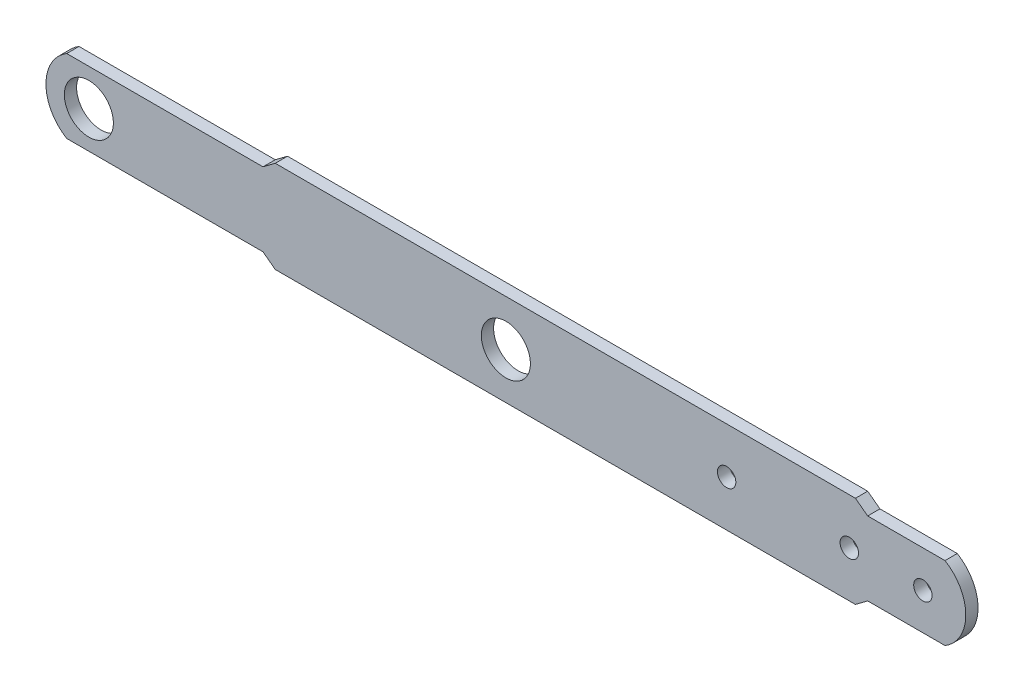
ISO-10303-21;
HEADER;
FILE_DESCRIPTION(('STEP AP214'),'2;1');
FILE_NAME('part.step','',(''),(''),'','','');
FILE_SCHEMA(('AUTOMOTIVE_DESIGN { 1 0 10303 214 1 1 1 1 }'));
ENDSEC;
DATA;
#1=APPLICATION_CONTEXT('core data for automotive mechanical design processes');
#2=APPLICATION_PROTOCOL_DEFINITION('international standard','automotive_design',2000,#1);
#3=PRODUCT_CONTEXT('',#1,'mechanical');
#4=PRODUCT('Part','Part','',(#3));
#5=PRODUCT_RELATED_PRODUCT_CATEGORY('part','',(#4));
#6=PRODUCT_DEFINITION_FORMATION('','',#4);
#7=PRODUCT_DEFINITION_CONTEXT('part definition',#1,'design');
#8=PRODUCT_DEFINITION('design','',#6,#7);
#9=PRODUCT_DEFINITION_SHAPE('','',#8);
#10=(LENGTH_UNIT() NAMED_UNIT(*) SI_UNIT(.MILLI.,.METRE.));
#11=(NAMED_UNIT(*) PLANE_ANGLE_UNIT() SI_UNIT($,.RADIAN.));
#12=(NAMED_UNIT(*) SI_UNIT($,.STERADIAN.) SOLID_ANGLE_UNIT());
#13=UNCERTAINTY_MEASURE_WITH_UNIT(LENGTH_MEASURE(1.E-05),#10,'distance_accuracy_value','');
#14=(GEOMETRIC_REPRESENTATION_CONTEXT(3) GLOBAL_UNCERTAINTY_ASSIGNED_CONTEXT((#13)) GLOBAL_UNIT_ASSIGNED_CONTEXT((#10,
#11,#12)) REPRESENTATION_CONTEXT('',''));
#15=CARTESIAN_POINT('',(0.,0.,0.));
#16=DIRECTION('',(0.,0.,1.));
#17=DIRECTION('',(1.,0.,0.));
#18=AXIS2_PLACEMENT_3D('',#15,#16,#17);
#19=CARTESIAN_POINT('',(-68.,0.,2.));
#20=DIRECTION('',(0.,0.,-1.));
#21=DIRECTION('',(-1.,0.,0.));
#22=AXIS2_PLACEMENT_3D('',#19,#20,#21);
#23=PLANE('',#22);
#24=CARTESIAN_POINT('',(0.,0.,2.));
#25=DIRECTION('',(0.,0.,1.));
#26=DIRECTION('',(1.,0.,0.));
#27=AXIS2_PLACEMENT_3D('',#24,#25,#26);
#28=CIRCLE('',#27,4.);
#29=CARTESIAN_POINT('',(4.,0.,2.));
#30=VERTEX_POINT('',#29);
#31=EDGE_CURVE('E311',#30,#30,#28,.T.);
#32=ORIENTED_EDGE('',*,*,#31,.F.);
#33=EDGE_LOOP('',(#32));
#34=FACE_BOUND('',#33,.T.);
#35=CARTESIAN_POINT('',(-68.,0.,2.));
#36=DIRECTION('',(0.,0.,1.));
#37=DIRECTION('',(-1.,0.,0.));
#38=AXIS2_PLACEMENT_3D('',#35,#36,#37);
#39=CIRCLE('',#38,4.00000000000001);
#40=CARTESIAN_POINT('',(-72.,0.,2.));
#41=VERTEX_POINT('',#40);
#42=EDGE_CURVE('E323',#41,#41,#39,.T.);
#43=ORIENTED_EDGE('',*,*,#42,.F.);
#44=EDGE_LOOP('',(#43));
#45=FACE_BOUND('',#44,.T.);
#46=DIRECTION('',(-1.,0.,0.));
#47=VECTOR('',#46,1.);
#48=CARTESIAN_POINT('',(57.,7.49999999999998,2.));
#49=LINE('',#48,#47);
#50=CARTESIAN_POINT('',(57.,7.49999999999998,2.));
#51=VERTEX_POINT('',#50);
#52=CARTESIAN_POINT('',(-37.605551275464,7.49999999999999,2.));
#53=VERTEX_POINT('',#52);
#54=EDGE_CURVE('E167',#51,#53,#49,.T.);
#55=ORIENTED_EDGE('',*,*,#54,.T.);
#56=DIRECTION('',(-0.800000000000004,-0.599999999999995,0.));
#57=VECTOR('',#56,1.);
#58=CARTESIAN_POINT('',(-37.605551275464,7.49999999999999,2.));
#59=LINE('',#58,#57);
#60=CARTESIAN_POINT('',(-39.605551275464,6.,2.));
#61=VERTEX_POINT('',#60);
#62=EDGE_CURVE('E136',#53,#61,#59,.T.);
#63=ORIENTED_EDGE('',*,*,#62,.T.);
#64=DIRECTION('',(-1.,0.,0.));
#65=VECTOR('',#64,1.);
#66=CARTESIAN_POINT('',(-71.605551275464,5.99999999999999,2.));
#67=LINE('',#66,#65);
#68=CARTESIAN_POINT('',(-71.605551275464,5.99999999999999,2.));
#69=VERTEX_POINT('',#68);
#70=EDGE_CURVE('E170',#61,#69,#67,.T.);
#71=ORIENTED_EDGE('',*,*,#70,.T.);
#72=CARTESIAN_POINT('',(-68.,0.,2.));
#73=DIRECTION('',(0.,0.,1.));
#74=DIRECTION('',(-1.,0.,0.));
#75=AXIS2_PLACEMENT_3D('',#72,#73,#74);
#76=CIRCLE('',#75,7.);
#77=CARTESIAN_POINT('',(-71.605551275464,-5.99999999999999,2.));
#78=VERTEX_POINT('',#77);
#79=EDGE_CURVE('E172',#69,#78,#76,.T.);
#80=ORIENTED_EDGE('',*,*,#79,.T.);
#81=DIRECTION('',(1.,0.,0.));
#82=VECTOR('',#81,1.);
#83=CARTESIAN_POINT('',(-71.605551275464,-5.99999999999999,2.));
#84=LINE('',#83,#82);
#85=CARTESIAN_POINT('',(-39.605551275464,-6.,2.));
#86=VERTEX_POINT('',#85);
#87=EDGE_CURVE('E174',#78,#86,#84,.T.);
#88=ORIENTED_EDGE('',*,*,#87,.T.);
#89=DIRECTION('',(0.800000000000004,-0.599999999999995,0.));
#90=VECTOR('',#89,1.);
#91=CARTESIAN_POINT('',(-37.605551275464,-7.49999999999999,2.));
#92=LINE('',#91,#90);
#93=CARTESIAN_POINT('',(-37.605551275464,-7.49999999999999,2.));
#94=VERTEX_POINT('',#93);
#95=EDGE_CURVE('E176',#86,#94,#92,.T.);
#96=ORIENTED_EDGE('',*,*,#95,.T.);
#97=DIRECTION('',(1.,0.,0.));
#98=VECTOR('',#97,1.);
#99=CARTESIAN_POINT('',(57.,-7.49999999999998,2.));
#100=LINE('',#99,#98);
#101=CARTESIAN_POINT('',(57.,-7.49999999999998,2.));
#102=VERTEX_POINT('',#101);
#103=EDGE_CURVE('E178',#94,#102,#100,.T.);
#104=ORIENTED_EDGE('',*,*,#103,.T.);
#105=DIRECTION('',(0.800000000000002,0.599999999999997,0.));
#106=VECTOR('',#105,1.);
#107=CARTESIAN_POINT('',(59.,-6.,2.));
#108=LINE('',#107,#106);
#109=CARTESIAN_POINT('',(59.,-6.,2.));
#110=VERTEX_POINT('',#109);
#111=EDGE_CURVE('E180',#102,#110,#108,.T.);
#112=ORIENTED_EDGE('',*,*,#111,.T.);
#113=DIRECTION('',(1.,0.,0.));
#114=VECTOR('',#113,1.);
#115=CARTESIAN_POINT('',(71.605551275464,-5.99999999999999,2.));
#116=LINE('',#115,#114);
#117=CARTESIAN_POINT('',(71.605551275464,-6.,2.));
#118=VERTEX_POINT('',#117);
#119=EDGE_CURVE('E182',#110,#118,#116,.T.);
#120=ORIENTED_EDGE('',*,*,#119,.T.);
#121=CARTESIAN_POINT('',(68.,0.,2.));
#122=DIRECTION('',(0.,0.,1.));
#123=DIRECTION('',(1.,0.,0.));
#124=AXIS2_PLACEMENT_3D('',#121,#122,#123);
#125=CIRCLE('',#124,7.);
#126=CARTESIAN_POINT('',(71.605551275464,5.99999999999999,2.));
#127=VERTEX_POINT('',#126);
#128=EDGE_CURVE('E184',#118,#127,#125,.T.);
#129=ORIENTED_EDGE('',*,*,#128,.T.);
#130=DIRECTION('',(-1.,0.,0.));
#131=VECTOR('',#130,1.);
#132=CARTESIAN_POINT('',(71.605551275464,5.99999999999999,2.));
#133=LINE('',#132,#131);
#134=CARTESIAN_POINT('',(59.,6.,2.));
#135=VERTEX_POINT('',#134);
#136=EDGE_CURVE('E53',#127,#135,#133,.T.);
#137=ORIENTED_EDGE('',*,*,#136,.T.);
#138=DIRECTION('',(-0.800000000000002,0.599999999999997,0.));
#139=VECTOR('',#138,1.);
#140=CARTESIAN_POINT('',(59.,6.,2.));
#141=LINE('',#140,#139);
#142=EDGE_CURVE('E48',#135,#51,#141,.T.);
#143=ORIENTED_EDGE('',*,*,#142,.T.);
#144=EDGE_LOOP('',(#55,#63,#71,#80,#88,#96,#104,#112,#120,#129,#137,#143));
#145=FACE_BOUND('',#144,.T.);
#146=CARTESIAN_POINT('',(68.,0.,2.));
#147=DIRECTION('',(0.,0.,1.));
#148=DIRECTION('',(1.,0.,0.));
#149=AXIS2_PLACEMENT_3D('',#146,#147,#148);
#150=CIRCLE('',#149,1.5);
#151=CARTESIAN_POINT('',(69.5,0.,2.));
#152=VERTEX_POINT('',#151);
#153=EDGE_CURVE('E141',#152,#152,#150,.T.);
#154=ORIENTED_EDGE('',*,*,#153,.F.);
#155=EDGE_LOOP('',(#154));
#156=FACE_BOUND('',#155,.T.);
#157=CARTESIAN_POINT('',(56.,0.,2.));
#158=DIRECTION('',(0.,0.,1.));
#159=DIRECTION('',(1.,0.,0.));
#160=AXIS2_PLACEMENT_3D('',#157,#158,#159);
#161=CIRCLE('',#160,1.5);
#162=CARTESIAN_POINT('',(57.5,0.,2.));
#163=VERTEX_POINT('',#162);
#164=EDGE_CURVE('E317',#163,#163,#161,.T.);
#165=ORIENTED_EDGE('',*,*,#164,.F.);
#166=EDGE_LOOP('',(#165));
#167=FACE_BOUND('',#166,.T.);
#168=CARTESIAN_POINT('',(36.,0.,2.));
#169=DIRECTION('',(0.,0.,1.));
#170=DIRECTION('',(1.,0.,0.));
#171=AXIS2_PLACEMENT_3D('',#168,#169,#170);
#172=CIRCLE('',#171,1.5);
#173=CARTESIAN_POINT('',(37.5,0.,2.));
#174=VERTEX_POINT('',#173);
#175=EDGE_CURVE('E300',#174,#174,#172,.T.);
#176=ORIENTED_EDGE('',*,*,#175,.F.);
#177=EDGE_LOOP('',(#176));
#178=FACE_BOUND('',#177,.T.);
#179=ADVANCED_FACE('F33',(#34,#45,#145,#156,#167,#178),#23,.F.);
#180=CARTESIAN_POINT('',(-68.,0.,0.));
#181=DIRECTION('',(0.,0.,-1.));
#182=DIRECTION('',(-1.,0.,0.));
#183=AXIS2_PLACEMENT_3D('',#180,#181,#182);
#184=PLANE('',#183);
#185=CARTESIAN_POINT('',(0.,0.,0.));
#186=DIRECTION('',(0.,0.,1.));
#187=DIRECTION('',(1.,0.,0.));
#188=AXIS2_PLACEMENT_3D('',#185,#186,#187);
#189=CIRCLE('',#188,4.);
#190=CARTESIAN_POINT('',(4.,0.,0.));
#191=VERTEX_POINT('',#190);
#192=EDGE_CURVE('E306',#191,#191,#189,.T.);
#193=ORIENTED_EDGE('',*,*,#192,.T.);
#194=EDGE_LOOP('',(#193));
#195=FACE_BOUND('',#194,.T.);
#196=CARTESIAN_POINT('',(-68.,0.,0.));
#197=DIRECTION('',(0.,0.,1.));
#198=DIRECTION('',(-1.,0.,0.));
#199=AXIS2_PLACEMENT_3D('',#196,#197,#198);
#200=CIRCLE('',#199,4.00000000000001);
#201=CARTESIAN_POINT('',(-72.,0.,0.));
#202=VERTEX_POINT('',#201);
#203=EDGE_CURVE('E320',#202,#202,#200,.T.);
#204=ORIENTED_EDGE('',*,*,#203,.T.);
#205=EDGE_LOOP('',(#204));
#206=FACE_BOUND('',#205,.T.);
#207=DIRECTION('',(-1.,0.,0.));
#208=VECTOR('',#207,1.);
#209=CARTESIAN_POINT('',(57.,7.49999999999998,0.));
#210=LINE('',#209,#208);
#211=CARTESIAN_POINT('',(57.,7.49999999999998,0.));
#212=VERTEX_POINT('',#211);
#213=CARTESIAN_POINT('',(-37.605551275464,7.49999999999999,0.));
#214=VERTEX_POINT('',#213);
#215=EDGE_CURVE('E127',#212,#214,#210,.T.);
#216=ORIENTED_EDGE('',*,*,#215,.F.);
#217=DIRECTION('',(-0.800000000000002,0.599999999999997,0.));
#218=VECTOR('',#217,1.);
#219=CARTESIAN_POINT('',(59.,6.,0.));
#220=LINE('',#219,#218);
#221=CARTESIAN_POINT('',(59.,6.,0.));
#222=VERTEX_POINT('',#221);
#223=EDGE_CURVE('E165',#222,#212,#220,.T.);
#224=ORIENTED_EDGE('',*,*,#223,.F.);
#225=DIRECTION('',(-1.,0.,0.));
#226=VECTOR('',#225,1.);
#227=CARTESIAN_POINT('',(71.605551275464,5.99999999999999,0.));
#228=LINE('',#227,#226);
#229=CARTESIAN_POINT('',(71.605551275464,5.99999999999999,0.));
#230=VERTEX_POINT('',#229);
#231=EDGE_CURVE('E163',#230,#222,#228,.T.);
#232=ORIENTED_EDGE('',*,*,#231,.F.);
#233=CARTESIAN_POINT('',(68.,0.,0.));
#234=DIRECTION('',(0.,0.,1.));
#235=DIRECTION('',(1.,0.,0.));
#236=AXIS2_PLACEMENT_3D('',#233,#234,#235);
#237=CIRCLE('',#236,7.);
#238=CARTESIAN_POINT('',(71.605551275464,-6.,0.));
#239=VERTEX_POINT('',#238);
#240=EDGE_CURVE('E161',#239,#230,#237,.T.);
#241=ORIENTED_EDGE('',*,*,#240,.F.);
#242=DIRECTION('',(1.,0.,0.));
#243=VECTOR('',#242,1.);
#244=CARTESIAN_POINT('',(71.605551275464,-5.99999999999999,0.));
#245=LINE('',#244,#243);
#246=CARTESIAN_POINT('',(59.,-6.,0.));
#247=VERTEX_POINT('',#246);
#248=EDGE_CURVE('E159',#247,#239,#245,.T.);
#249=ORIENTED_EDGE('',*,*,#248,.F.);
#250=DIRECTION('',(0.800000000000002,0.599999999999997,0.));
#251=VECTOR('',#250,1.);
#252=CARTESIAN_POINT('',(59.,-6.,0.));
#253=LINE('',#252,#251);
#254=CARTESIAN_POINT('',(57.,-7.49999999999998,0.));
#255=VERTEX_POINT('',#254);
#256=EDGE_CURVE('E157',#255,#247,#253,.T.);
#257=ORIENTED_EDGE('',*,*,#256,.F.);
#258=DIRECTION('',(1.,0.,0.));
#259=VECTOR('',#258,1.);
#260=CARTESIAN_POINT('',(57.,-7.49999999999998,0.));
#261=LINE('',#260,#259);
#262=CARTESIAN_POINT('',(-37.605551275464,-7.49999999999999,0.));
#263=VERTEX_POINT('',#262);
#264=EDGE_CURVE('E155',#263,#255,#261,.T.);
#265=ORIENTED_EDGE('',*,*,#264,.F.);
#266=DIRECTION('',(0.800000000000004,-0.599999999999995,0.));
#267=VECTOR('',#266,1.);
#268=CARTESIAN_POINT('',(-37.605551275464,-7.49999999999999,0.));
#269=LINE('',#268,#267);
#270=CARTESIAN_POINT('',(-39.605551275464,-6.,0.));
#271=VERTEX_POINT('',#270);
#272=EDGE_CURVE('E153',#271,#263,#269,.T.);
#273=ORIENTED_EDGE('',*,*,#272,.F.);
#274=DIRECTION('',(1.,0.,0.));
#275=VECTOR('',#274,1.);
#276=CARTESIAN_POINT('',(-71.605551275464,-5.99999999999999,0.));
#277=LINE('',#276,#275);
#278=CARTESIAN_POINT('',(-71.605551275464,-5.99999999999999,0.));
#279=VERTEX_POINT('',#278);
#280=EDGE_CURVE('E151',#279,#271,#277,.T.);
#281=ORIENTED_EDGE('',*,*,#280,.F.);
#282=CARTESIAN_POINT('',(-68.,0.,0.));
#283=DIRECTION('',(0.,0.,1.));
#284=DIRECTION('',(-1.,0.,0.));
#285=AXIS2_PLACEMENT_3D('',#282,#283,#284);
#286=CIRCLE('',#285,7.);
#287=CARTESIAN_POINT('',(-71.605551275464,5.99999999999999,0.));
#288=VERTEX_POINT('',#287);
#289=EDGE_CURVE('E149',#288,#279,#286,.T.);
#290=ORIENTED_EDGE('',*,*,#289,.F.);
#291=DIRECTION('',(-1.,0.,0.));
#292=VECTOR('',#291,1.);
#293=CARTESIAN_POINT('',(-71.605551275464,5.99999999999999,0.));
#294=LINE('',#293,#292);
#295=CARTESIAN_POINT('',(-39.605551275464,6.,0.));
#296=VERTEX_POINT('',#295);
#297=EDGE_CURVE('E129',#296,#288,#294,.T.);
#298=ORIENTED_EDGE('',*,*,#297,.F.);
#299=DIRECTION('',(-0.800000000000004,-0.599999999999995,0.));
#300=VECTOR('',#299,1.);
#301=CARTESIAN_POINT('',(-37.605551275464,7.49999999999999,0.));
#302=LINE('',#301,#300);
#303=EDGE_CURVE('E122',#214,#296,#302,.T.);
#304=ORIENTED_EDGE('',*,*,#303,.F.);
#305=EDGE_LOOP('',(#216,#224,#232,#241,#249,#257,#265,#273,#281,#290,#298,#304));
#306=FACE_BOUND('',#305,.T.);
#307=CARTESIAN_POINT('',(68.,0.,0.));
#308=DIRECTION('',(0.,0.,1.));
#309=DIRECTION('',(1.,0.,0.));
#310=AXIS2_PLACEMENT_3D('',#307,#308,#309);
#311=CIRCLE('',#310,1.5);
#312=CARTESIAN_POINT('',(69.5,0.,0.));
#313=VERTEX_POINT('',#312);
#314=EDGE_CURVE('E144',#313,#313,#311,.T.);
#315=ORIENTED_EDGE('',*,*,#314,.T.);
#316=EDGE_LOOP('',(#315));
#317=FACE_BOUND('',#316,.T.);
#318=CARTESIAN_POINT('',(56.,0.,0.));
#319=DIRECTION('',(0.,0.,1.));
#320=DIRECTION('',(1.,0.,0.));
#321=AXIS2_PLACEMENT_3D('',#318,#319,#320);
#322=CIRCLE('',#321,1.5);
#323=CARTESIAN_POINT('',(57.5,0.,0.));
#324=VERTEX_POINT('',#323);
#325=EDGE_CURVE('E314',#324,#324,#322,.T.);
#326=ORIENTED_EDGE('',*,*,#325,.T.);
#327=EDGE_LOOP('',(#326));
#328=FACE_BOUND('',#327,.T.);
#329=CARTESIAN_POINT('',(36.,0.,0.));
#330=DIRECTION('',(0.,0.,1.));
#331=DIRECTION('',(1.,0.,0.));
#332=AXIS2_PLACEMENT_3D('',#329,#330,#331);
#333=CIRCLE('',#332,1.5);
#334=CARTESIAN_POINT('',(37.5,0.,0.));
#335=VERTEX_POINT('',#334);
#336=EDGE_CURVE('E303',#335,#335,#333,.T.);
#337=ORIENTED_EDGE('',*,*,#336,.T.);
#338=EDGE_LOOP('',(#337));
#339=FACE_BOUND('',#338,.T.);
#340=ADVANCED_FACE('F123',(#195,#206,#306,#317,#328,#339),#184,.T.);
#341=CARTESIAN_POINT('',(57.,7.49999999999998,2.));
#342=DIRECTION('',(0.,-1.,0.));
#343=DIRECTION('',(1.,0.,0.));
#344=AXIS2_PLACEMENT_3D('',#341,#342,#343);
#345=PLANE('',#344);
#346=ORIENTED_EDGE('',*,*,#215,.T.);
#347=DIRECTION('',(0.,0.,-1.));
#348=VECTOR('',#347,1.);
#349=CARTESIAN_POINT('',(-37.605551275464,7.49999999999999,2.));
#350=LINE('',#349,#348);
#351=EDGE_CURVE('E11',#53,#214,#350,.T.);
#352=ORIENTED_EDGE('',*,*,#351,.F.);
#353=ORIENTED_EDGE('',*,*,#54,.F.);
#354=DIRECTION('',(0.,0.,-1.));
#355=VECTOR('',#354,1.);
#356=CARTESIAN_POINT('',(57.,7.49999999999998,2.));
#357=LINE('',#356,#355);
#358=EDGE_CURVE('E140',#51,#212,#357,.T.);
#359=ORIENTED_EDGE('',*,*,#358,.T.);
#360=EDGE_LOOP('',(#346,#352,#353,#359));
#361=FACE_BOUND('',#360,.T.);
#362=ADVANCED_FACE('F35',(#361),#345,.F.);
#363=CARTESIAN_POINT('',(-37.605551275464,7.49999999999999,2.));
#364=DIRECTION('',(0.599999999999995,-0.800000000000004,0.));
#365=DIRECTION('',(0.800000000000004,0.599999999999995,0.));
#366=AXIS2_PLACEMENT_3D('',#363,#364,#365);
#367=PLANE('',#366);
#368=ORIENTED_EDGE('',*,*,#303,.T.);
#369=DIRECTION('',(0.,0.,-1.));
#370=VECTOR('',#369,1.);
#371=CARTESIAN_POINT('',(-39.605551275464,6.,2.));
#372=LINE('',#371,#370);
#373=EDGE_CURVE('E41',#61,#296,#372,.T.);
#374=ORIENTED_EDGE('',*,*,#373,.F.);
#375=ORIENTED_EDGE('',*,*,#62,.F.);
#376=ORIENTED_EDGE('',*,*,#351,.T.);
#377=EDGE_LOOP('',(#368,#374,#375,#376));
#378=FACE_BOUND('',#377,.T.);
#379=ADVANCED_FACE('F135',(#378),#367,.F.);
#380=CARTESIAN_POINT('',(-71.605551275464,5.99999999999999,2.));
#381=DIRECTION('',(0.,-1.,0.));
#382=DIRECTION('',(1.,0.,0.));
#383=AXIS2_PLACEMENT_3D('',#380,#381,#382);
#384=PLANE('',#383);
#385=ORIENTED_EDGE('',*,*,#297,.T.);
#386=DIRECTION('',(0.,0.,-1.));
#387=VECTOR('',#386,1.);
#388=CARTESIAN_POINT('',(-71.605551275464,5.99999999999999,2.));
#389=LINE('',#388,#387);
#390=EDGE_CURVE('E213',#69,#288,#389,.T.);
#391=ORIENTED_EDGE('',*,*,#390,.F.);
#392=ORIENTED_EDGE('',*,*,#70,.F.);
#393=ORIENTED_EDGE('',*,*,#373,.T.);
#394=EDGE_LOOP('',(#385,#391,#392,#393));
#395=FACE_BOUND('',#394,.T.);
#396=ADVANCED_FACE('F217',(#395),#384,.F.);
#397=CARTESIAN_POINT('',(-68.,0.,2.));
#398=DIRECTION('',(0.,0.,-1.));
#399=DIRECTION('',(-1.,0.,0.));
#400=AXIS2_PLACEMENT_3D('',#397,#398,#399);
#401=CYLINDRICAL_SURFACE('',#400,7.);
#402=ORIENTED_EDGE('',*,*,#289,.T.);
#403=DIRECTION('',(0.,0.,-1.));
#404=VECTOR('',#403,1.);
#405=CARTESIAN_POINT('',(-71.605551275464,-5.99999999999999,2.));
#406=LINE('',#405,#404);
#407=EDGE_CURVE('E210',#78,#279,#406,.T.);
#408=ORIENTED_EDGE('',*,*,#407,.F.);
#409=ORIENTED_EDGE('',*,*,#79,.F.);
#410=ORIENTED_EDGE('',*,*,#390,.T.);
#411=EDGE_LOOP('',(#402,#408,#409,#410));
#412=FACE_BOUND('',#411,.T.);
#413=ADVANCED_FACE('F225',(#412),#401,.T.);
#414=CARTESIAN_POINT('',(-71.605551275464,-5.99999999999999,2.));
#415=DIRECTION('',(0.,1.,0.));
#416=DIRECTION('',(-1.,0.,0.));
#417=AXIS2_PLACEMENT_3D('',#414,#415,#416);
#418=PLANE('',#417);
#419=ORIENTED_EDGE('',*,*,#280,.T.);
#420=DIRECTION('',(0.,0.,-1.));
#421=VECTOR('',#420,1.);
#422=CARTESIAN_POINT('',(-39.605551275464,-6.,2.));
#423=LINE('',#422,#421);
#424=EDGE_CURVE('E207',#86,#271,#423,.T.);
#425=ORIENTED_EDGE('',*,*,#424,.F.);
#426=ORIENTED_EDGE('',*,*,#87,.F.);
#427=ORIENTED_EDGE('',*,*,#407,.T.);
#428=EDGE_LOOP('',(#419,#425,#426,#427));
#429=FACE_BOUND('',#428,.T.);
#430=ADVANCED_FACE('F228',(#429),#418,.F.);
#431=CARTESIAN_POINT('',(-37.605551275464,-7.49999999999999,2.));
#432=DIRECTION('',(0.599999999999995,0.800000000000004,0.));
#433=DIRECTION('',(-0.800000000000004,0.599999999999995,0.));
#434=AXIS2_PLACEMENT_3D('',#431,#432,#433);
#435=PLANE('',#434);
#436=ORIENTED_EDGE('',*,*,#272,.T.);
#437=DIRECTION('',(0.,0.,-1.));
#438=VECTOR('',#437,1.);
#439=CARTESIAN_POINT('',(-37.605551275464,-7.49999999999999,2.));
#440=LINE('',#439,#438);
#441=EDGE_CURVE('E204',#94,#263,#440,.T.);
#442=ORIENTED_EDGE('',*,*,#441,.F.);
#443=ORIENTED_EDGE('',*,*,#95,.F.);
#444=ORIENTED_EDGE('',*,*,#424,.T.);
#445=EDGE_LOOP('',(#436,#442,#443,#444));
#446=FACE_BOUND('',#445,.T.);
#447=ADVANCED_FACE('F233',(#446),#435,.F.);
#448=CARTESIAN_POINT('',(57.,-7.49999999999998,2.));
#449=DIRECTION('',(0.,1.,0.));
#450=DIRECTION('',(-1.,0.,0.));
#451=AXIS2_PLACEMENT_3D('',#448,#449,#450);
#452=PLANE('',#451);
#453=ORIENTED_EDGE('',*,*,#264,.T.);
#454=DIRECTION('',(0.,0.,-1.));
#455=VECTOR('',#454,1.);
#456=CARTESIAN_POINT('',(57.,-7.49999999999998,2.));
#457=LINE('',#456,#455);
#458=EDGE_CURVE('E201',#102,#255,#457,.T.);
#459=ORIENTED_EDGE('',*,*,#458,.F.);
#460=ORIENTED_EDGE('',*,*,#103,.F.);
#461=ORIENTED_EDGE('',*,*,#441,.T.);
#462=EDGE_LOOP('',(#453,#459,#460,#461));
#463=FACE_BOUND('',#462,.T.);
#464=ADVANCED_FACE('F239',(#463),#452,.F.);
#465=CARTESIAN_POINT('',(59.,-6.,2.));
#466=DIRECTION('',(-0.599999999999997,0.800000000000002,0.));
#467=DIRECTION('',(-0.800000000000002,-0.599999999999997,0.));
#468=AXIS2_PLACEMENT_3D('',#465,#466,#467);
#469=PLANE('',#468);
#470=ORIENTED_EDGE('',*,*,#256,.T.);
#471=DIRECTION('',(0.,0.,-1.));
#472=VECTOR('',#471,1.);
#473=CARTESIAN_POINT('',(59.,-6.,2.));
#474=LINE('',#473,#472);
#475=EDGE_CURVE('E198',#110,#247,#474,.T.);
#476=ORIENTED_EDGE('',*,*,#475,.F.);
#477=ORIENTED_EDGE('',*,*,#111,.F.);
#478=ORIENTED_EDGE('',*,*,#458,.T.);
#479=EDGE_LOOP('',(#470,#476,#477,#478));
#480=FACE_BOUND('',#479,.T.);
#481=ADVANCED_FACE('F243',(#480),#469,.F.);
#482=CARTESIAN_POINT('',(71.605551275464,-5.99999999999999,2.));
#483=DIRECTION('',(0.,1.,0.));
#484=DIRECTION('',(-1.,0.,0.));
#485=AXIS2_PLACEMENT_3D('',#482,#483,#484);
#486=PLANE('',#485);
#487=ORIENTED_EDGE('',*,*,#248,.T.);
#488=DIRECTION('',(0.,0.,-1.));
#489=VECTOR('',#488,1.);
#490=CARTESIAN_POINT('',(71.605551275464,-6.,2.));
#491=LINE('',#490,#489);
#492=EDGE_CURVE('E195',#118,#239,#491,.T.);
#493=ORIENTED_EDGE('',*,*,#492,.F.);
#494=ORIENTED_EDGE('',*,*,#119,.F.);
#495=ORIENTED_EDGE('',*,*,#475,.T.);
#496=EDGE_LOOP('',(#487,#493,#494,#495));
#497=FACE_BOUND('',#496,.T.);
#498=ADVANCED_FACE('F248',(#497),#486,.F.);
#499=CARTESIAN_POINT('',(68.,0.,2.));
#500=DIRECTION('',(0.,0.,-1.));
#501=DIRECTION('',(-1.,0.,0.));
#502=AXIS2_PLACEMENT_3D('',#499,#500,#501);
#503=CYLINDRICAL_SURFACE('',#502,7.);
#504=ORIENTED_EDGE('',*,*,#240,.T.);
#505=DIRECTION('',(0.,0.,-1.));
#506=VECTOR('',#505,1.);
#507=CARTESIAN_POINT('',(71.605551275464,5.99999999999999,2.));
#508=LINE('',#507,#506);
#509=EDGE_CURVE('E192',#127,#230,#508,.T.);
#510=ORIENTED_EDGE('',*,*,#509,.F.);
#511=ORIENTED_EDGE('',*,*,#128,.F.);
#512=ORIENTED_EDGE('',*,*,#492,.T.);
#513=EDGE_LOOP('',(#504,#510,#511,#512));
#514=FACE_BOUND('',#513,.T.);
#515=ADVANCED_FACE('F252',(#514),#503,.T.);
#516=CARTESIAN_POINT('',(71.605551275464,5.99999999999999,2.));
#517=DIRECTION('',(0.,-1.,0.));
#518=DIRECTION('',(1.,0.,0.));
#519=AXIS2_PLACEMENT_3D('',#516,#517,#518);
#520=PLANE('',#519);
#521=ORIENTED_EDGE('',*,*,#231,.T.);
#522=DIRECTION('',(0.,0.,-1.));
#523=VECTOR('',#522,1.);
#524=CARTESIAN_POINT('',(59.,6.,2.));
#525=LINE('',#524,#523);
#526=EDGE_CURVE('E189',#135,#222,#525,.T.);
#527=ORIENTED_EDGE('',*,*,#526,.F.);
#528=ORIENTED_EDGE('',*,*,#136,.F.);
#529=ORIENTED_EDGE('',*,*,#509,.T.);
#530=EDGE_LOOP('',(#521,#527,#528,#529));
#531=FACE_BOUND('',#530,.T.);
#532=ADVANCED_FACE('F256',(#531),#520,.F.);
#533=CARTESIAN_POINT('',(59.,6.,2.));
#534=DIRECTION('',(-0.599999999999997,-0.800000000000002,0.));
#535=DIRECTION('',(0.800000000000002,-0.599999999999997,0.));
#536=AXIS2_PLACEMENT_3D('',#533,#534,#535);
#537=PLANE('',#536);
#538=ORIENTED_EDGE('',*,*,#223,.T.);
#539=ORIENTED_EDGE('',*,*,#358,.F.);
#540=ORIENTED_EDGE('',*,*,#142,.F.);
#541=ORIENTED_EDGE('',*,*,#526,.T.);
#542=EDGE_LOOP('',(#538,#539,#540,#541));
#543=FACE_BOUND('',#542,.T.);
#544=ADVANCED_FACE('F258',(#543),#537,.F.);
#545=CARTESIAN_POINT('',(68.,0.,2.));
#546=DIRECTION('',(0.,0.,-1.));
#547=DIRECTION('',(-1.,0.,0.));
#548=AXIS2_PLACEMENT_3D('',#545,#546,#547);
#549=CYLINDRICAL_SURFACE('',#548,1.5);
#550=ORIENTED_EDGE('',*,*,#153,.T.);
#551=EDGE_LOOP('',(#550));
#552=FACE_BOUND('',#551,.T.);
#553=ORIENTED_EDGE('',*,*,#314,.F.);
#554=EDGE_LOOP('',(#553));
#555=FACE_BOUND('',#554,.T.);
#556=ADVANCED_FACE('F260',(#552,#555),#549,.F.);
#557=CARTESIAN_POINT('',(-68.,0.,2.));
#558=DIRECTION('',(0.,0.,-1.));
#559=DIRECTION('',(-1.,0.,0.));
#560=AXIS2_PLACEMENT_3D('',#557,#558,#559);
#561=CYLINDRICAL_SURFACE('',#560,4.00000000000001);
#562=ORIENTED_EDGE('',*,*,#42,.T.);
#563=EDGE_LOOP('',(#562));
#564=FACE_BOUND('',#563,.T.);
#565=ORIENTED_EDGE('',*,*,#203,.F.);
#566=EDGE_LOOP('',(#565));
#567=FACE_BOUND('',#566,.T.);
#568=ADVANCED_FACE('F266',(#564,#567),#561,.F.);
#569=CARTESIAN_POINT('',(56.,0.,2.));
#570=DIRECTION('',(0.,0.,-1.));
#571=DIRECTION('',(-1.,0.,0.));
#572=AXIS2_PLACEMENT_3D('',#569,#570,#571);
#573=CYLINDRICAL_SURFACE('',#572,1.5);
#574=ORIENTED_EDGE('',*,*,#164,.T.);
#575=EDGE_LOOP('',(#574));
#576=FACE_BOUND('',#575,.T.);
#577=ORIENTED_EDGE('',*,*,#325,.F.);
#578=EDGE_LOOP('',(#577));
#579=FACE_BOUND('',#578,.T.);
#580=ADVANCED_FACE('F283',(#576,#579),#573,.F.);
#581=CARTESIAN_POINT('',(0.,0.,2.));
#582=DIRECTION('',(0.,0.,-1.));
#583=DIRECTION('',(-1.,0.,0.));
#584=AXIS2_PLACEMENT_3D('',#581,#582,#583);
#585=CYLINDRICAL_SURFACE('',#584,4.);
#586=ORIENTED_EDGE('',*,*,#31,.T.);
#587=EDGE_LOOP('',(#586));
#588=FACE_BOUND('',#587,.T.);
#589=ORIENTED_EDGE('',*,*,#192,.F.);
#590=EDGE_LOOP('',(#589));
#591=FACE_BOUND('',#590,.T.);
#592=ADVANCED_FACE('F287',(#588,#591),#585,.F.);
#593=CARTESIAN_POINT('',(36.,0.,2.));
#594=DIRECTION('',(0.,0.,-1.));
#595=DIRECTION('',(-1.,0.,0.));
#596=AXIS2_PLACEMENT_3D('',#593,#594,#595);
#597=CYLINDRICAL_SURFACE('',#596,1.5);
#598=ORIENTED_EDGE('',*,*,#175,.T.);
#599=EDGE_LOOP('',(#598));
#600=FACE_BOUND('',#599,.T.);
#601=ORIENTED_EDGE('',*,*,#336,.F.);
#602=EDGE_LOOP('',(#601));
#603=FACE_BOUND('',#602,.T.);
#604=ADVANCED_FACE('F291',(#600,#603),#597,.F.);
#605=CLOSED_SHELL('',(#179,#340,#362,#379,#396,#413,#430,#447,#464,#481,#498,#515,#532,#544,
#556,#568,#580,#592,#604));
#606=MANIFOLD_SOLID_BREP('B2',#605);
#607=ADVANCED_BREP_SHAPE_REPRESENTATION('',(#18,#606),#14);
#608=SHAPE_DEFINITION_REPRESENTATION(#9,#607);
ENDSEC;
END-ISO-10303-21;
